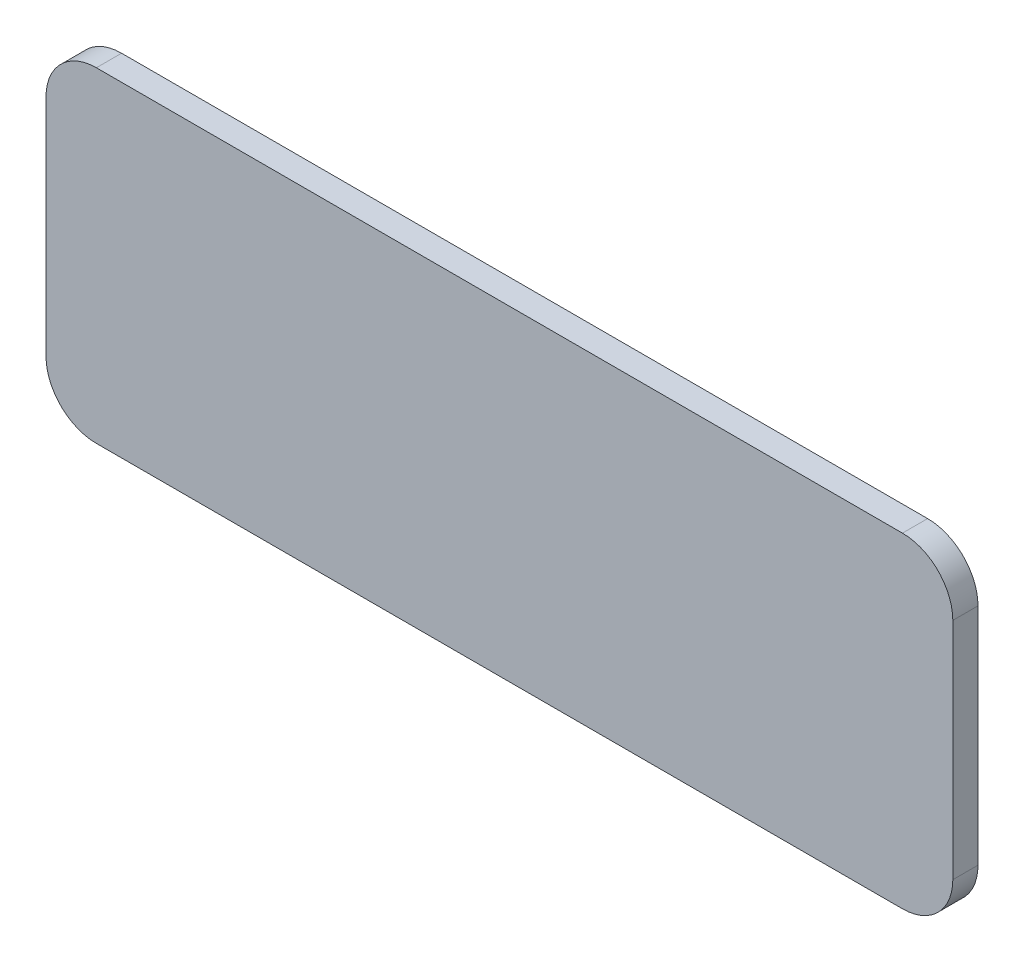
ISO-10303-21;
HEADER;
FILE_DESCRIPTION(('STEP AP214'),'2;1');
FILE_NAME('part.step','',(''),(''),'','','');
FILE_SCHEMA(('AUTOMOTIVE_DESIGN { 1 0 10303 214 1 1 1 1 }'));
ENDSEC;
DATA;
#1=APPLICATION_CONTEXT('core data for automotive mechanical design processes');
#2=APPLICATION_PROTOCOL_DEFINITION('international standard','automotive_design',2000,#1);
#3=PRODUCT_CONTEXT('',#1,'mechanical');
#4=PRODUCT('Part','Part','',(#3));
#5=PRODUCT_RELATED_PRODUCT_CATEGORY('part','',(#4));
#6=PRODUCT_DEFINITION_FORMATION('','',#4);
#7=PRODUCT_DEFINITION_CONTEXT('part definition',#1,'design');
#8=PRODUCT_DEFINITION('design','',#6,#7);
#9=PRODUCT_DEFINITION_SHAPE('','',#8);
#10=(LENGTH_UNIT() NAMED_UNIT(*) SI_UNIT(.MILLI.,.METRE.));
#11=(NAMED_UNIT(*) PLANE_ANGLE_UNIT() SI_UNIT($,.RADIAN.));
#12=(NAMED_UNIT(*) SI_UNIT($,.STERADIAN.) SOLID_ANGLE_UNIT());
#13=UNCERTAINTY_MEASURE_WITH_UNIT(LENGTH_MEASURE(1.E-05),#10,'distance_accuracy_value','');
#14=(GEOMETRIC_REPRESENTATION_CONTEXT(3) GLOBAL_UNCERTAINTY_ASSIGNED_CONTEXT((#13)) GLOBAL_UNIT_ASSIGNED_CONTEXT((#10,
#11,#12)) REPRESENTATION_CONTEXT('',''));
#15=CARTESIAN_POINT('',(0.,0.,0.));
#16=DIRECTION('',(0.,0.,1.));
#17=DIRECTION('',(1.,0.,0.));
#18=AXIS2_PLACEMENT_3D('',#15,#16,#17);
#19=CARTESIAN_POINT('',(15.5,-1.0919554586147,-0.5));
#20=DIRECTION('',(0.,0.,1.));
#21=DIRECTION('',(1.,0.,0.));
#22=AXIS2_PLACEMENT_3D('',#19,#20,#21);
#23=CYLINDRICAL_SURFACE('',#22,1.);
#24=CARTESIAN_POINT('',(15.5,-1.0919554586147,0.));
#25=DIRECTION('',(0.,0.,1.));
#26=DIRECTION('',(-1.,0.,0.));
#27=AXIS2_PLACEMENT_3D('',#24,#25,#26);
#28=CIRCLE('',#27,1.);
#29=CARTESIAN_POINT('',(15.5,-0.0919554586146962,0.));
#30=VERTEX_POINT('',#29);
#31=CARTESIAN_POINT('',(14.5,-1.0919554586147,0.));
#32=VERTEX_POINT('',#31);
#33=EDGE_CURVE('E127',#30,#32,#28,.T.);
#34=ORIENTED_EDGE('',*,*,#33,.F.);
#35=DIRECTION('',(0.,0.,1.));
#36=VECTOR('',#35,1.);
#37=CARTESIAN_POINT('',(15.5,-0.0919554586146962,-0.5));
#38=LINE('',#37,#36);
#39=CARTESIAN_POINT('',(15.5,-0.0919554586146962,-0.5));
#40=VERTEX_POINT('',#39);
#41=EDGE_CURVE('E11',#40,#30,#38,.T.);
#42=ORIENTED_EDGE('',*,*,#41,.F.);
#43=CARTESIAN_POINT('',(15.5,-1.0919554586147,-0.5));
#44=DIRECTION('',(0.,0.,1.));
#45=DIRECTION('',(-1.,0.,0.));
#46=AXIS2_PLACEMENT_3D('',#43,#44,#45);
#47=CIRCLE('',#46,1.);
#48=CARTESIAN_POINT('',(14.5,-1.0919554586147,-0.5));
#49=VERTEX_POINT('',#48);
#50=EDGE_CURVE('E147',#40,#49,#47,.T.);
#51=ORIENTED_EDGE('',*,*,#50,.T.);
#52=DIRECTION('',(0.,0.,1.));
#53=VECTOR('',#52,1.);
#54=CARTESIAN_POINT('',(14.5,-1.0919554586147,-0.5));
#55=LINE('',#54,#53);
#56=EDGE_CURVE('E33',#49,#32,#55,.T.);
#57=ORIENTED_EDGE('',*,*,#56,.T.);
#58=EDGE_LOOP('',(#34,#42,#51,#57));
#59=FACE_BOUND('',#58,.T.);
#60=ADVANCED_FACE('F30',(#59),#23,.T.);
#61=CARTESIAN_POINT('',(15.5,-0.0919554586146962,-0.5));
#62=DIRECTION('',(0.,1.,0.));
#63=DIRECTION('',(-1.,0.,0.));
#64=AXIS2_PLACEMENT_3D('',#61,#62,#63);
#65=PLANE('',#64);
#66=DIRECTION('',(-1.,0.,0.));
#67=VECTOR('',#66,1.);
#68=CARTESIAN_POINT('',(15.5,-0.0919554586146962,0.));
#69=LINE('',#68,#67);
#70=CARTESIAN_POINT('',(31.5,-0.0919554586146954,0.));
#71=VERTEX_POINT('',#70);
#72=EDGE_CURVE('E145',#71,#30,#69,.T.);
#73=ORIENTED_EDGE('',*,*,#72,.F.);
#74=DIRECTION('',(0.,0.,1.));
#75=VECTOR('',#74,1.);
#76=CARTESIAN_POINT('',(31.5,-0.0919554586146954,-0.5));
#77=LINE('',#76,#75);
#78=CARTESIAN_POINT('',(31.5,-0.0919554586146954,-0.5));
#79=VERTEX_POINT('',#78);
#80=EDGE_CURVE('E39',#79,#71,#77,.T.);
#81=ORIENTED_EDGE('',*,*,#80,.F.);
#82=DIRECTION('',(-1.,0.,0.));
#83=VECTOR('',#82,1.);
#84=CARTESIAN_POINT('',(15.5,-0.0919554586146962,-0.5));
#85=LINE('',#84,#83);
#86=EDGE_CURVE('E117',#79,#40,#85,.T.);
#87=ORIENTED_EDGE('',*,*,#86,.T.);
#88=ORIENTED_EDGE('',*,*,#41,.T.);
#89=EDGE_LOOP('',(#73,#81,#87,#88));
#90=FACE_BOUND('',#89,.T.);
#91=ADVANCED_FACE('F159',(#90),#65,.T.);
#92=CARTESIAN_POINT('',(31.5,-1.0919554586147,-0.5));
#93=DIRECTION('',(0.,0.,1.));
#94=DIRECTION('',(1.,0.,0.));
#95=AXIS2_PLACEMENT_3D('',#92,#93,#94);
#96=CYLINDRICAL_SURFACE('',#95,1.);
#97=CARTESIAN_POINT('',(31.5,-1.0919554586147,0.));
#98=DIRECTION('',(0.,0.,1.));
#99=DIRECTION('',(-1.,0.,0.));
#100=AXIS2_PLACEMENT_3D('',#97,#98,#99);
#101=CIRCLE('',#100,1.);
#102=CARTESIAN_POINT('',(32.5,-1.0919554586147,0.));
#103=VERTEX_POINT('',#102);
#104=EDGE_CURVE('E104',#103,#71,#101,.T.);
#105=ORIENTED_EDGE('',*,*,#104,.F.);
#106=DIRECTION('',(0.,0.,1.));
#107=VECTOR('',#106,1.);
#108=CARTESIAN_POINT('',(32.5,-1.0919554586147,-0.5));
#109=LINE('',#108,#107);
#110=CARTESIAN_POINT('',(32.5,-1.0919554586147,-0.5));
#111=VERTEX_POINT('',#110);
#112=EDGE_CURVE('E99',#111,#103,#109,.T.);
#113=ORIENTED_EDGE('',*,*,#112,.F.);
#114=CARTESIAN_POINT('',(31.5,-1.0919554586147,-0.5));
#115=DIRECTION('',(0.,0.,1.));
#116=DIRECTION('',(-1.,0.,0.));
#117=AXIS2_PLACEMENT_3D('',#114,#115,#116);
#118=CIRCLE('',#117,1.);
#119=EDGE_CURVE('E102',#111,#79,#118,.T.);
#120=ORIENTED_EDGE('',*,*,#119,.T.);
#121=ORIENTED_EDGE('',*,*,#80,.T.);
#122=EDGE_LOOP('',(#105,#113,#120,#121));
#123=FACE_BOUND('',#122,.T.);
#124=ADVANCED_FACE('F101',(#123),#96,.T.);
#125=CARTESIAN_POINT('',(32.5,-1.0919554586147,-0.5));
#126=DIRECTION('',(1.,0.,0.));
#127=DIRECTION('',(0.,0.,-1.));
#128=AXIS2_PLACEMENT_3D('',#125,#126,#127);
#129=PLANE('',#128);
#130=DIRECTION('',(0.,1.,0.));
#131=VECTOR('',#130,1.);
#132=CARTESIAN_POINT('',(32.5,-1.0919554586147,0.));
#133=LINE('',#132,#131);
#134=CARTESIAN_POINT('',(32.5,-5.54999999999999,0.));
#135=VERTEX_POINT('',#134);
#136=EDGE_CURVE('E142',#135,#103,#133,.T.);
#137=ORIENTED_EDGE('',*,*,#136,.F.);
#138=DIRECTION('',(0.,0.,1.));
#139=VECTOR('',#138,1.);
#140=CARTESIAN_POINT('',(32.5,-5.54999999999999,-0.5));
#141=LINE('',#140,#139);
#142=CARTESIAN_POINT('',(32.5,-5.54999999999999,-0.5));
#143=VERTEX_POINT('',#142);
#144=EDGE_CURVE('E109',#143,#135,#141,.T.);
#145=ORIENTED_EDGE('',*,*,#144,.F.);
#146=DIRECTION('',(0.,1.,0.));
#147=VECTOR('',#146,1.);
#148=CARTESIAN_POINT('',(32.5,-1.0919554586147,-0.5));
#149=LINE('',#148,#147);
#150=EDGE_CURVE('E115',#143,#111,#149,.T.);
#151=ORIENTED_EDGE('',*,*,#150,.T.);
#152=ORIENTED_EDGE('',*,*,#112,.T.);
#153=EDGE_LOOP('',(#137,#145,#151,#152));
#154=FACE_BOUND('',#153,.T.);
#155=ADVANCED_FACE('F119',(#154),#129,.T.);
#156=CARTESIAN_POINT('',(31.5,-5.55,-0.5));
#157=DIRECTION('',(0.,0.,1.));
#158=DIRECTION('',(1.,0.,0.));
#159=AXIS2_PLACEMENT_3D('',#156,#157,#158);
#160=CYLINDRICAL_SURFACE('',#159,1.);
#161=CARTESIAN_POINT('',(31.5,-5.55,0.));
#162=DIRECTION('',(0.,0.,1.));
#163=DIRECTION('',(1.,0.,0.));
#164=AXIS2_PLACEMENT_3D('',#161,#162,#163);
#165=CIRCLE('',#164,1.);
#166=CARTESIAN_POINT('',(31.5,-6.55,0.));
#167=VERTEX_POINT('',#166);
#168=EDGE_CURVE('E139',#167,#135,#165,.T.);
#169=ORIENTED_EDGE('',*,*,#168,.F.);
#170=DIRECTION('',(0.,0.,1.));
#171=VECTOR('',#170,1.);
#172=CARTESIAN_POINT('',(31.5,-6.55,-0.5));
#173=LINE('',#172,#171);
#174=CARTESIAN_POINT('',(31.5,-6.55,-0.5));
#175=VERTEX_POINT('',#174);
#176=EDGE_CURVE('E151',#175,#167,#173,.T.);
#177=ORIENTED_EDGE('',*,*,#176,.F.);
#178=CARTESIAN_POINT('',(31.5,-5.55,-0.5));
#179=DIRECTION('',(0.,0.,1.));
#180=DIRECTION('',(1.,0.,0.));
#181=AXIS2_PLACEMENT_3D('',#178,#179,#180);
#182=CIRCLE('',#181,1.);
#183=EDGE_CURVE('E120',#175,#143,#182,.T.);
#184=ORIENTED_EDGE('',*,*,#183,.T.);
#185=ORIENTED_EDGE('',*,*,#144,.T.);
#186=EDGE_LOOP('',(#169,#177,#184,#185));
#187=FACE_BOUND('',#186,.T.);
#188=ADVANCED_FACE('F172',(#187),#160,.T.);
#189=CARTESIAN_POINT('',(15.5,-6.55,-0.5));
#190=DIRECTION('',(0.,-1.,0.));
#191=DIRECTION('',(0.,0.,-1.));
#192=AXIS2_PLACEMENT_3D('',#189,#190,#191);
#193=PLANE('',#192);
#194=DIRECTION('',(1.,0.,0.));
#195=VECTOR('',#194,1.);
#196=CARTESIAN_POINT('',(15.5,-6.55,0.));
#197=LINE('',#196,#195);
#198=CARTESIAN_POINT('',(15.5,-6.55,0.));
#199=VERTEX_POINT('',#198);
#200=EDGE_CURVE('E136',#199,#167,#197,.T.);
#201=ORIENTED_EDGE('',*,*,#200,.F.);
#202=DIRECTION('',(0.,0.,1.));
#203=VECTOR('',#202,1.);
#204=CARTESIAN_POINT('',(15.5,-6.55,-0.5));
#205=LINE('',#204,#203);
#206=CARTESIAN_POINT('',(15.5,-6.55,-0.5));
#207=VERTEX_POINT('',#206);
#208=EDGE_CURVE('E153',#207,#199,#205,.T.);
#209=ORIENTED_EDGE('',*,*,#208,.F.);
#210=DIRECTION('',(1.,0.,0.));
#211=VECTOR('',#210,1.);
#212=CARTESIAN_POINT('',(15.5,-6.55,-0.5));
#213=LINE('',#212,#211);
#214=EDGE_CURVE('E122',#207,#175,#213,.T.);
#215=ORIENTED_EDGE('',*,*,#214,.T.);
#216=ORIENTED_EDGE('',*,*,#176,.T.);
#217=EDGE_LOOP('',(#201,#209,#215,#216));
#218=FACE_BOUND('',#217,.T.);
#219=ADVANCED_FACE('F175',(#218),#193,.T.);
#220=CARTESIAN_POINT('',(15.5,-5.55,-0.5));
#221=DIRECTION('',(0.,0.,1.));
#222=DIRECTION('',(1.,0.,0.));
#223=AXIS2_PLACEMENT_3D('',#220,#221,#222);
#224=CYLINDRICAL_SURFACE('',#223,1.);
#225=CARTESIAN_POINT('',(15.5,-5.55,0.));
#226=DIRECTION('',(0.,0.,1.));
#227=DIRECTION('',(-1.,0.,0.));
#228=AXIS2_PLACEMENT_3D('',#225,#226,#227);
#229=CIRCLE('',#228,1.);
#230=CARTESIAN_POINT('',(14.5,-5.54999999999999,0.));
#231=VERTEX_POINT('',#230);
#232=EDGE_CURVE('E133',#231,#199,#229,.T.);
#233=ORIENTED_EDGE('',*,*,#232,.F.);
#234=DIRECTION('',(0.,0.,1.));
#235=VECTOR('',#234,1.);
#236=CARTESIAN_POINT('',(14.5,-5.54999999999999,-0.5));
#237=LINE('',#236,#235);
#238=CARTESIAN_POINT('',(14.5,-5.54999999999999,-0.5));
#239=VERTEX_POINT('',#238);
#240=EDGE_CURVE('E154',#239,#231,#237,.T.);
#241=ORIENTED_EDGE('',*,*,#240,.F.);
#242=CARTESIAN_POINT('',(15.5,-5.55,-0.5));
#243=DIRECTION('',(0.,0.,1.));
#244=DIRECTION('',(-1.,0.,0.));
#245=AXIS2_PLACEMENT_3D('',#242,#243,#244);
#246=CIRCLE('',#245,1.);
#247=EDGE_CURVE('E250',#239,#207,#246,.T.);
#248=ORIENTED_EDGE('',*,*,#247,.T.);
#249=ORIENTED_EDGE('',*,*,#208,.T.);
#250=EDGE_LOOP('',(#233,#241,#248,#249));
#251=FACE_BOUND('',#250,.T.);
#252=ADVANCED_FACE('F179',(#251),#224,.T.);
#253=CARTESIAN_POINT('',(14.5,-1.0919554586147,-0.5));
#254=DIRECTION('',(-1.,0.,0.));
#255=DIRECTION('',(0.,0.,1.));
#256=AXIS2_PLACEMENT_3D('',#253,#254,#255);
#257=PLANE('',#256);
#258=DIRECTION('',(0.,-1.,0.));
#259=VECTOR('',#258,1.);
#260=CARTESIAN_POINT('',(14.5,-1.0919554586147,0.));
#261=LINE('',#260,#259);
#262=EDGE_CURVE('E130',#32,#231,#261,.T.);
#263=ORIENTED_EDGE('',*,*,#262,.F.);
#264=ORIENTED_EDGE('',*,*,#56,.F.);
#265=DIRECTION('',(0.,-1.,0.));
#266=VECTOR('',#265,1.);
#267=CARTESIAN_POINT('',(14.5,-1.0919554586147,-0.5));
#268=LINE('',#267,#266);
#269=EDGE_CURVE('E251',#49,#239,#268,.T.);
#270=ORIENTED_EDGE('',*,*,#269,.T.);
#271=ORIENTED_EDGE('',*,*,#240,.T.);
#272=EDGE_LOOP('',(#263,#264,#270,#271));
#273=FACE_BOUND('',#272,.T.);
#274=ADVANCED_FACE('F156',(#273),#257,.T.);
#275=CARTESIAN_POINT('',(15.5,-1.0919554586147,-0.5));
#276=DIRECTION('',(0.,0.,-1.));
#277=DIRECTION('',(-1.,0.,0.));
#278=AXIS2_PLACEMENT_3D('',#275,#276,#277);
#279=PLANE('',#278);
#280=ORIENTED_EDGE('',*,*,#50,.F.);
#281=ORIENTED_EDGE('',*,*,#86,.F.);
#282=ORIENTED_EDGE('',*,*,#119,.F.);
#283=ORIENTED_EDGE('',*,*,#150,.F.);
#284=ORIENTED_EDGE('',*,*,#183,.F.);
#285=ORIENTED_EDGE('',*,*,#214,.F.);
#286=ORIENTED_EDGE('',*,*,#247,.F.);
#287=ORIENTED_EDGE('',*,*,#269,.F.);
#288=EDGE_LOOP('',(#280,#281,#282,#283,#284,#285,#286,#287));
#289=FACE_BOUND('',#288,.T.);
#290=ADVANCED_FACE('F113',(#289),#279,.T.);
#291=CARTESIAN_POINT('',(15.5,-1.0919554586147,0.));
#292=DIRECTION('',(0.,0.,-1.));
#293=DIRECTION('',(-1.,0.,0.));
#294=AXIS2_PLACEMENT_3D('',#291,#292,#293);
#295=PLANE('',#294);
#296=ORIENTED_EDGE('',*,*,#33,.T.);
#297=ORIENTED_EDGE('',*,*,#262,.T.);
#298=ORIENTED_EDGE('',*,*,#232,.T.);
#299=ORIENTED_EDGE('',*,*,#200,.T.);
#300=ORIENTED_EDGE('',*,*,#168,.T.);
#301=ORIENTED_EDGE('',*,*,#136,.T.);
#302=ORIENTED_EDGE('',*,*,#104,.T.);
#303=ORIENTED_EDGE('',*,*,#72,.T.);
#304=EDGE_LOOP('',(#296,#297,#298,#299,#300,#301,#302,#303));
#305=FACE_BOUND('',#304,.T.);
#306=ADVANCED_FACE('F158',(#305),#295,.F.);
#307=CLOSED_SHELL('',(#60,#91,#124,#155,#188,#219,#252,#274,#290,#306));
#308=MANIFOLD_SOLID_BREP('B2',#307);
#309=ADVANCED_BREP_SHAPE_REPRESENTATION('',(#18,#308),#14);
#310=SHAPE_DEFINITION_REPRESENTATION(#9,#309);
ENDSEC;
END-ISO-10303-21;
